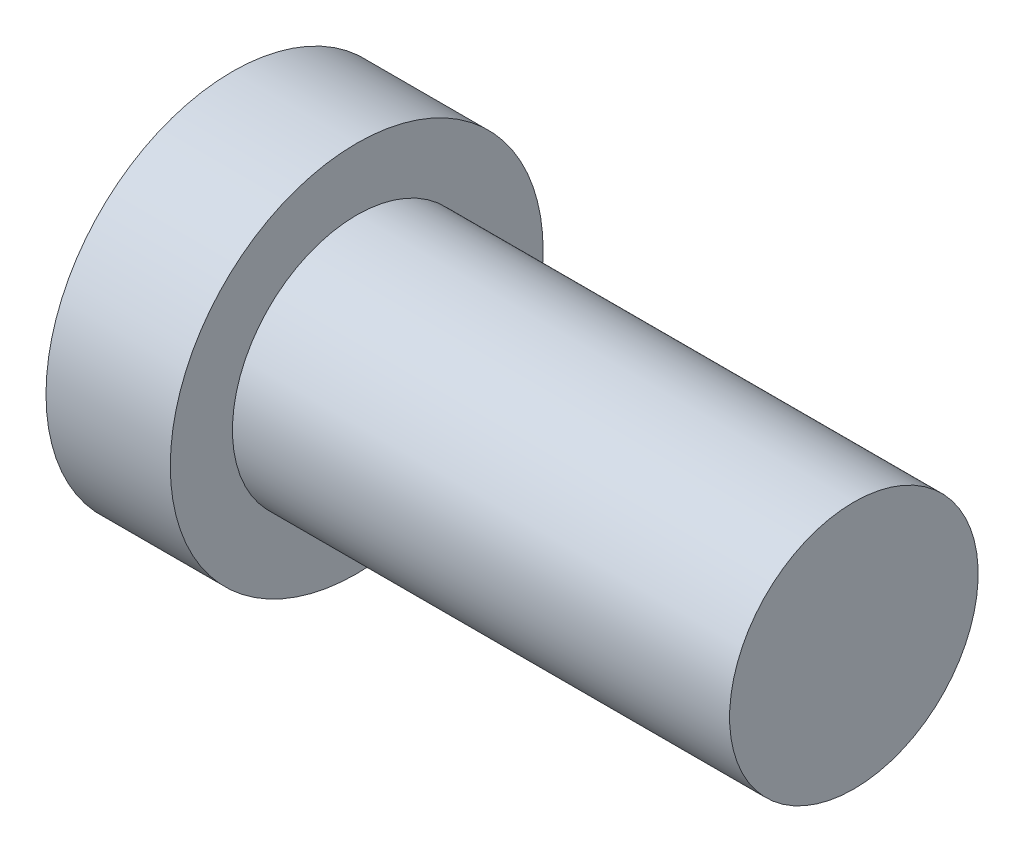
from build123d import *


with BuildPart() as part:
    # Sketch1 → Revolve1 (revolve)
    with BuildSketch(Plane.XY):
        Polygon((0, 0), (0, 3.81), (2.54, 3.81), (2.54, 2.54), (12.7, 2.54), (12.7, 0), align=None)
    revolve(axis=Axis((12.7, 0, 0), (-1, 0, 0)))


solid = part.part
